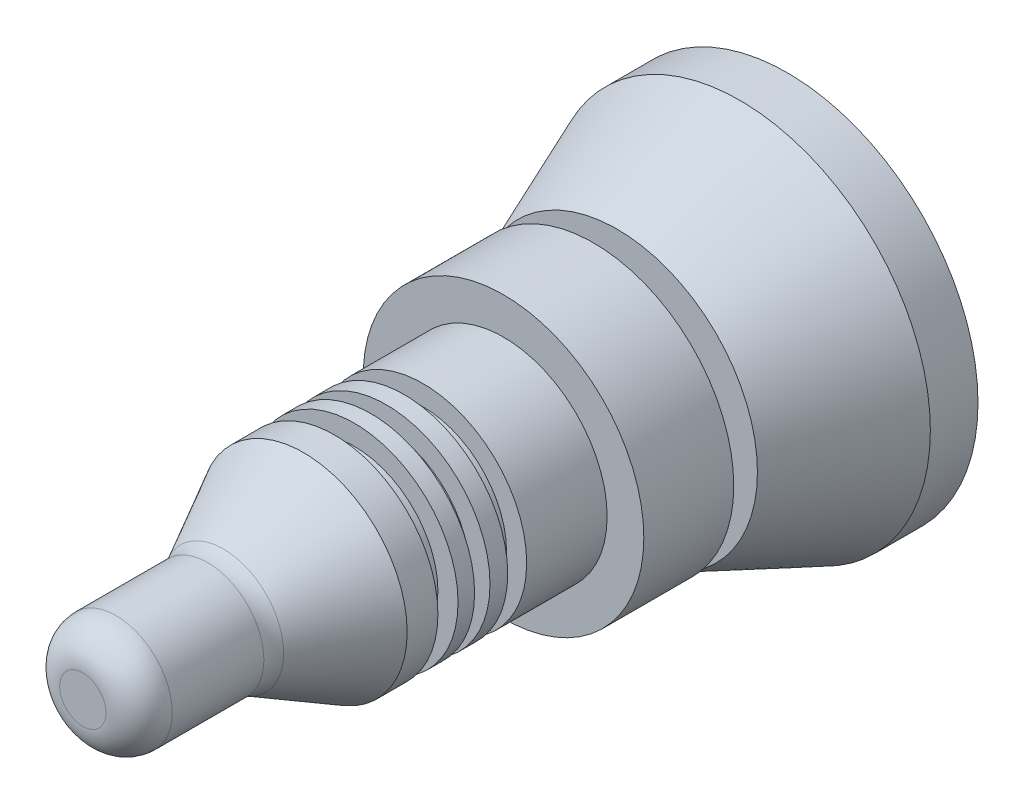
ISO-10303-21;
HEADER;
FILE_DESCRIPTION(('STEP AP214'),'2;1');
FILE_NAME('part.step','',(''),(''),'','','');
FILE_SCHEMA(('AUTOMOTIVE_DESIGN { 1 0 10303 214 1 1 1 1 }'));
ENDSEC;
DATA;
#1=APPLICATION_CONTEXT('core data for automotive mechanical design processes');
#2=APPLICATION_PROTOCOL_DEFINITION('international standard','automotive_design',2000,#1);
#3=PRODUCT_CONTEXT('',#1,'mechanical');
#4=PRODUCT('Part','Part','',(#3));
#5=PRODUCT_RELATED_PRODUCT_CATEGORY('part','',(#4));
#6=PRODUCT_DEFINITION_FORMATION('','',#4);
#7=PRODUCT_DEFINITION_CONTEXT('part definition',#1,'design');
#8=PRODUCT_DEFINITION('design','',#6,#7);
#9=PRODUCT_DEFINITION_SHAPE('','',#8);
#10=(LENGTH_UNIT() NAMED_UNIT(*) SI_UNIT(.MILLI.,.METRE.));
#11=(NAMED_UNIT(*) PLANE_ANGLE_UNIT() SI_UNIT($,.RADIAN.));
#12=(NAMED_UNIT(*) SI_UNIT($,.STERADIAN.) SOLID_ANGLE_UNIT());
#13=UNCERTAINTY_MEASURE_WITH_UNIT(LENGTH_MEASURE(1.E-05),#10,'distance_accuracy_value','');
#14=(GEOMETRIC_REPRESENTATION_CONTEXT(3) GLOBAL_UNCERTAINTY_ASSIGNED_CONTEXT((#13)) GLOBAL_UNIT_ASSIGNED_CONTEXT((#10,
#11,#12)) REPRESENTATION_CONTEXT('',''));
#15=CARTESIAN_POINT('',(0.,0.,0.));
#16=DIRECTION('',(0.,0.,1.));
#17=DIRECTION('',(1.,0.,0.));
#18=AXIS2_PLACEMENT_3D('',#15,#16,#17);
#19=CARTESIAN_POINT('',(0.,57.5552010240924,-212.836397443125));
#20=DIRECTION('',(0.,0.,1.));
#21=DIRECTION('',(1.,0.,0.));
#22=AXIS2_PLACEMENT_3D('',#19,#20,#21);
#23=PLANE('',#22);
#24=CARTESIAN_POINT('',(0.,0.,-212.836397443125));
#25=DIRECTION('',(0.,0.,1.));
#26=DIRECTION('',(1.,0.,0.));
#27=AXIS2_PLACEMENT_3D('',#24,#25,#26);
#28=CIRCLE('',#27,57.5552010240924);
#29=CARTESIAN_POINT('',(57.5552010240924,0.,-212.836397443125));
#30=VERTEX_POINT('',#29);
#31=EDGE_CURVE('E10',#30,#30,#28,.T.);
#32=ORIENTED_EDGE('',*,*,#31,.F.);
#33=EDGE_LOOP('',(#32));
#34=FACE_BOUND('',#33,.T.);
#35=ADVANCED_FACE('F29',(#34),#23,.F.);
#36=CARTESIAN_POINT('',(0.,0.,62.7325331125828));
#37=DIRECTION('',(0.,0.,1.));
#38=DIRECTION('',(1.,0.,0.));
#39=AXIS2_PLACEMENT_3D('',#36,#37,#38);
#40=CYLINDRICAL_SURFACE('',#39,57.5552010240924);
#41=CARTESIAN_POINT('',(0.,0.,-198.447054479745));
#42=DIRECTION('',(0.,0.,1.));
#43=DIRECTION('',(1.,0.,0.));
#44=AXIS2_PLACEMENT_3D('',#41,#42,#43);
#45=CIRCLE('',#44,57.5552010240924);
#46=CARTESIAN_POINT('',(57.5552010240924,0.,-198.447054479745));
#47=VERTEX_POINT('',#46);
#48=EDGE_CURVE('E35',#47,#47,#45,.T.);
#49=ORIENTED_EDGE('',*,*,#48,.F.);
#50=EDGE_LOOP('',(#49));
#51=FACE_BOUND('',#50,.T.);
#52=ORIENTED_EDGE('',*,*,#31,.T.);
#53=EDGE_LOOP('',(#52));
#54=FACE_BOUND('',#53,.T.);
#55=ADVANCED_FACE('F248',(#51,#54),#40,.T.);
#56=CARTESIAN_POINT('',(0.,0.,-198.447054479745));
#57=DIRECTION('',(0.,0.,-1.));
#58=DIRECTION('',(-1.,0.,0.));
#59=AXIS2_PLACEMENT_3D('',#56,#57,#58);
#60=CONICAL_SURFACE('',#59,57.5552010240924,0.388689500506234);
#61=CARTESIAN_POINT('',(0.,0.,-161.388824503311));
#62=DIRECTION('',(0.,0.,1.));
#63=DIRECTION('',(1.,0.,0.));
#64=AXIS2_PLACEMENT_3D('',#61,#62,#63);
#65=CIRCLE('',#64,42.3789735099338);
#66=CARTESIAN_POINT('',(42.3789735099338,0.,-161.388824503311));
#67=VERTEX_POINT('',#66);
#68=EDGE_CURVE('E39',#67,#67,#65,.T.);
#69=ORIENTED_EDGE('',*,*,#68,.F.);
#70=EDGE_LOOP('',(#69));
#71=FACE_BOUND('',#70,.T.);
#72=ORIENTED_EDGE('',*,*,#48,.T.);
#73=EDGE_LOOP('',(#72));
#74=FACE_BOUND('',#73,.T.);
#75=ADVANCED_FACE('F243',(#71,#74),#60,.T.);
#76=CARTESIAN_POINT('',(0.,22.7192052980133,-161.388824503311));
#77=DIRECTION('',(0.,0.,-1.));
#78=DIRECTION('',(-1.,0.,0.));
#79=AXIS2_PLACEMENT_3D('',#76,#77,#78);
#80=PLANE('',#79);
#81=CARTESIAN_POINT('',(0.,0.,-161.388824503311));
#82=DIRECTION('',(0.,0.,1.));
#83=DIRECTION('',(1.,0.,0.));
#84=AXIS2_PLACEMENT_3D('',#81,#82,#83);
#85=CIRCLE('',#84,22.7192052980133);
#86=CARTESIAN_POINT('',(22.7192052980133,0.,-161.388824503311));
#87=VERTEX_POINT('',#86);
#88=EDGE_CURVE('E43',#87,#87,#85,.T.);
#89=ORIENTED_EDGE('',*,*,#88,.F.);
#90=EDGE_LOOP('',(#89));
#91=FACE_BOUND('',#90,.T.);
#92=ORIENTED_EDGE('',*,*,#68,.T.);
#93=EDGE_LOOP('',(#92));
#94=FACE_BOUND('',#93,.T.);
#95=ADVANCED_FACE('F237',(#91,#94),#80,.F.);
#96=CARTESIAN_POINT('',(0.,0.,62.7325331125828));
#97=DIRECTION('',(0.,0.,1.));
#98=DIRECTION('',(1.,0.,0.));
#99=AXIS2_PLACEMENT_3D('',#96,#97,#98);
#100=CYLINDRICAL_SURFACE('',#99,22.7192052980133);
#101=CARTESIAN_POINT('',(0.,0.,-154.239817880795));
#102=DIRECTION('',(0.,0.,1.));
#103=DIRECTION('',(1.,0.,0.));
#104=AXIS2_PLACEMENT_3D('',#101,#102,#103);
#105=CIRCLE('',#104,22.7192052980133);
#106=CARTESIAN_POINT('',(22.7192052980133,0.,-154.239817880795));
#107=VERTEX_POINT('',#106);
#108=EDGE_CURVE('E48',#107,#107,#105,.T.);
#109=ORIENTED_EDGE('',*,*,#108,.F.);
#110=EDGE_LOOP('',(#109));
#111=FACE_BOUND('',#110,.T.);
#112=ORIENTED_EDGE('',*,*,#88,.T.);
#113=EDGE_LOOP('',(#112));
#114=FACE_BOUND('',#113,.T.);
#115=ADVANCED_FACE('F231',(#111,#114),#100,.T.);
#116=CARTESIAN_POINT('',(0.,42.3789735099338,-154.239817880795));
#117=DIRECTION('',(0.,0.,1.));
#118=DIRECTION('',(1.,0.,0.));
#119=AXIS2_PLACEMENT_3D('',#116,#117,#118);
#120=PLANE('',#119);
#121=CARTESIAN_POINT('',(0.,0.,-154.239817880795));
#122=DIRECTION('',(0.,0.,1.));
#123=DIRECTION('',(1.,0.,0.));
#124=AXIS2_PLACEMENT_3D('',#121,#122,#123);
#125=CIRCLE('',#124,42.3789735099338);
#126=CARTESIAN_POINT('',(42.3789735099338,0.,-154.239817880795));
#127=VERTEX_POINT('',#126);
#128=EDGE_CURVE('E51',#127,#127,#125,.T.);
#129=ORIENTED_EDGE('',*,*,#128,.F.);
#130=EDGE_LOOP('',(#129));
#131=FACE_BOUND('',#130,.T.);
#132=ORIENTED_EDGE('',*,*,#108,.T.);
#133=EDGE_LOOP('',(#132));
#134=FACE_BOUND('',#133,.T.);
#135=ADVANCED_FACE('F225',(#131,#134),#120,.F.);
#136=CARTESIAN_POINT('',(0.,0.,62.7325331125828));
#137=DIRECTION('',(0.,0.,1.));
#138=DIRECTION('',(1.,0.,0.));
#139=AXIS2_PLACEMENT_3D('',#136,#137,#138);
#140=CYLINDRICAL_SURFACE('',#139,42.3789735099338);
#141=CARTESIAN_POINT('',(0.,0.,-127.073592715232));
#142=DIRECTION('',(0.,0.,1.));
#143=DIRECTION('',(1.,0.,0.));
#144=AXIS2_PLACEMENT_3D('',#141,#142,#143);
#145=CIRCLE('',#144,42.3789735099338);
#146=CARTESIAN_POINT('',(42.3789735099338,0.,-127.073592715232));
#147=VERTEX_POINT('',#146);
#148=EDGE_CURVE('E54',#147,#147,#145,.T.);
#149=ORIENTED_EDGE('',*,*,#148,.F.);
#150=EDGE_LOOP('',(#149));
#151=FACE_BOUND('',#150,.T.);
#152=ORIENTED_EDGE('',*,*,#128,.T.);
#153=EDGE_LOOP('',(#152));
#154=FACE_BOUND('',#153,.T.);
#155=ADVANCED_FACE('F219',(#151,#154),#140,.T.);
#156=CARTESIAN_POINT('',(0.,31.2980132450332,-127.073592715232));
#157=DIRECTION('',(0.,0.,-1.));
#158=DIRECTION('',(-1.,0.,0.));
#159=AXIS2_PLACEMENT_3D('',#156,#157,#158);
#160=PLANE('',#159);
#161=CARTESIAN_POINT('',(0.,0.,-127.073592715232));
#162=DIRECTION('',(0.,0.,1.));
#163=DIRECTION('',(1.,0.,0.));
#164=AXIS2_PLACEMENT_3D('',#161,#162,#163);
#165=CIRCLE('',#164,31.2980132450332);
#166=CARTESIAN_POINT('',(31.2980132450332,0.,-127.073592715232));
#167=VERTEX_POINT('',#166);
#168=EDGE_CURVE('E57',#167,#167,#165,.T.);
#169=ORIENTED_EDGE('',*,*,#168,.F.);
#170=EDGE_LOOP('',(#169));
#171=FACE_BOUND('',#170,.T.);
#172=ORIENTED_EDGE('',*,*,#148,.T.);
#173=EDGE_LOOP('',(#172));
#174=FACE_BOUND('',#173,.T.);
#175=ADVANCED_FACE('F213',(#171,#174),#160,.F.);
#176=CARTESIAN_POINT('',(0.,0.,62.7325331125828));
#177=DIRECTION('',(0.,0.,1.));
#178=DIRECTION('',(1.,0.,0.));
#179=AXIS2_PLACEMENT_3D('',#176,#177,#178);
#180=CYLINDRICAL_SURFACE('',#179,31.2980132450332);
#181=CARTESIAN_POINT('',(0.,0.,-102.766970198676));
#182=DIRECTION('',(0.,0.,1.));
#183=DIRECTION('',(1.,0.,0.));
#184=AXIS2_PLACEMENT_3D('',#181,#182,#183);
#185=CIRCLE('',#184,31.2980132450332);
#186=CARTESIAN_POINT('',(31.2980132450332,0.,-102.766970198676));
#187=VERTEX_POINT('',#186);
#188=EDGE_CURVE('E60',#187,#187,#185,.T.);
#189=ORIENTED_EDGE('',*,*,#188,.F.);
#190=EDGE_LOOP('',(#189));
#191=FACE_BOUND('',#190,.T.);
#192=ORIENTED_EDGE('',*,*,#168,.T.);
#193=EDGE_LOOP('',(#192));
#194=FACE_BOUND('',#193,.T.);
#195=ADVANCED_FACE('F207',(#191,#194),#180,.T.);
#196=CARTESIAN_POINT('',(0.,25.221357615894,-102.766970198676));
#197=DIRECTION('',(0.,0.,-1.));
#198=DIRECTION('',(-1.,0.,0.));
#199=AXIS2_PLACEMENT_3D('',#196,#197,#198);
#200=PLANE('',#199);
#201=CARTESIAN_POINT('',(0.,0.,-102.766970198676));
#202=DIRECTION('',(0.,0.,1.));
#203=DIRECTION('',(1.,0.,0.));
#204=AXIS2_PLACEMENT_3D('',#201,#202,#203);
#205=CIRCLE('',#204,25.221357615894);
#206=CARTESIAN_POINT('',(25.221357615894,0.,-102.766970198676));
#207=VERTEX_POINT('',#206);
#208=EDGE_CURVE('E63',#207,#207,#205,.T.);
#209=ORIENTED_EDGE('',*,*,#208,.F.);
#210=EDGE_LOOP('',(#209));
#211=FACE_BOUND('',#210,.T.);
#212=ORIENTED_EDGE('',*,*,#188,.T.);
#213=EDGE_LOOP('',(#212));
#214=FACE_BOUND('',#213,.T.);
#215=ADVANCED_FACE('F201',(#211,#214),#200,.F.);
#216=CARTESIAN_POINT('',(0.,0.,62.7325331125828));
#217=DIRECTION('',(0.,0.,1.));
#218=DIRECTION('',(1.,0.,0.));
#219=AXIS2_PLACEMENT_3D('',#216,#217,#218);
#220=CYLINDRICAL_SURFACE('',#219,25.221357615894);
#221=CARTESIAN_POINT('',(0.,0.,-97.0477649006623));
#222=DIRECTION('',(0.,0.,1.));
#223=DIRECTION('',(1.,0.,0.));
#224=AXIS2_PLACEMENT_3D('',#221,#222,#223);
#225=CIRCLE('',#224,25.221357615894);
#226=CARTESIAN_POINT('',(25.221357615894,0.,-97.0477649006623));
#227=VERTEX_POINT('',#226);
#228=EDGE_CURVE('E66',#227,#227,#225,.T.);
#229=ORIENTED_EDGE('',*,*,#228,.F.);
#230=EDGE_LOOP('',(#229));
#231=FACE_BOUND('',#230,.T.);
#232=ORIENTED_EDGE('',*,*,#208,.T.);
#233=EDGE_LOOP('',(#232));
#234=FACE_BOUND('',#233,.T.);
#235=ADVANCED_FACE('F195',(#231,#234),#220,.T.);
#236=CARTESIAN_POINT('',(0.,31.2980132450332,-97.0477649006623));
#237=DIRECTION('',(0.,0.,1.));
#238=DIRECTION('',(1.,0.,0.));
#239=AXIS2_PLACEMENT_3D('',#236,#237,#238);
#240=PLANE('',#239);
#241=CARTESIAN_POINT('',(0.,0.,-97.0477649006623));
#242=DIRECTION('',(0.,0.,1.));
#243=DIRECTION('',(1.,0.,0.));
#244=AXIS2_PLACEMENT_3D('',#241,#242,#243);
#245=CIRCLE('',#244,31.2980132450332);
#246=CARTESIAN_POINT('',(31.2980132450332,0.,-97.0477649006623));
#247=VERTEX_POINT('',#246);
#248=EDGE_CURVE('E69',#247,#247,#245,.T.);
#249=ORIENTED_EDGE('',*,*,#248,.F.);
#250=EDGE_LOOP('',(#249));
#251=FACE_BOUND('',#250,.T.);
#252=ORIENTED_EDGE('',*,*,#228,.T.);
#253=EDGE_LOOP('',(#252));
#254=FACE_BOUND('',#253,.T.);
#255=ADVANCED_FACE('F189',(#251,#254),#240,.F.);
#256=CARTESIAN_POINT('',(0.,0.,62.7325331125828));
#257=DIRECTION('',(0.,0.,1.));
#258=DIRECTION('',(1.,0.,0.));
#259=AXIS2_PLACEMENT_3D('',#256,#257,#258);
#260=CYLINDRICAL_SURFACE('',#259,31.2980132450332);
#261=CARTESIAN_POINT('',(0.,0.,-91.6860099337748));
#262=DIRECTION('',(0.,0.,1.));
#263=DIRECTION('',(1.,0.,0.));
#264=AXIS2_PLACEMENT_3D('',#261,#262,#263);
#265=CIRCLE('',#264,31.2980132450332);
#266=CARTESIAN_POINT('',(31.2980132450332,0.,-91.6860099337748));
#267=VERTEX_POINT('',#266);
#268=EDGE_CURVE('E72',#267,#267,#265,.T.);
#269=ORIENTED_EDGE('',*,*,#268,.F.);
#270=EDGE_LOOP('',(#269));
#271=FACE_BOUND('',#270,.T.);
#272=ORIENTED_EDGE('',*,*,#248,.T.);
#273=EDGE_LOOP('',(#272));
#274=FACE_BOUND('',#273,.T.);
#275=ADVANCED_FACE('F183',(#271,#274),#260,.T.);
#276=CARTESIAN_POINT('',(0.,25.221357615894,-91.6860099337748));
#277=DIRECTION('',(0.,0.,-1.));
#278=DIRECTION('',(-1.,0.,0.));
#279=AXIS2_PLACEMENT_3D('',#276,#277,#278);
#280=PLANE('',#279);
#281=CARTESIAN_POINT('',(0.,0.,-91.6860099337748));
#282=DIRECTION('',(0.,0.,1.));
#283=DIRECTION('',(1.,0.,0.));
#284=AXIS2_PLACEMENT_3D('',#281,#282,#283);
#285=CIRCLE('',#284,25.221357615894);
#286=CARTESIAN_POINT('',(25.221357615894,0.,-91.6860099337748));
#287=VERTEX_POINT('',#286);
#288=EDGE_CURVE('E75',#287,#287,#285,.T.);
#289=ORIENTED_EDGE('',*,*,#288,.F.);
#290=EDGE_LOOP('',(#289));
#291=FACE_BOUND('',#290,.T.);
#292=ORIENTED_EDGE('',*,*,#268,.T.);
#293=EDGE_LOOP('',(#292));
#294=FACE_BOUND('',#293,.T.);
#295=ADVANCED_FACE('F177',(#291,#294),#280,.F.);
#296=CARTESIAN_POINT('',(0.,0.,62.7325331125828));
#297=DIRECTION('',(0.,0.,1.));
#298=DIRECTION('',(1.,0.,0.));
#299=AXIS2_PLACEMENT_3D('',#296,#297,#298);
#300=CYLINDRICAL_SURFACE('',#299,25.221357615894);
#301=CARTESIAN_POINT('',(0.,0.,-87.0391556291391));
#302=DIRECTION('',(0.,0.,1.));
#303=DIRECTION('',(1.,0.,0.));
#304=AXIS2_PLACEMENT_3D('',#301,#302,#303);
#305=CIRCLE('',#304,25.221357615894);
#306=CARTESIAN_POINT('',(25.221357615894,0.,-87.0391556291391));
#307=VERTEX_POINT('',#306);
#308=EDGE_CURVE('E78',#307,#307,#305,.T.);
#309=ORIENTED_EDGE('',*,*,#308,.F.);
#310=EDGE_LOOP('',(#309));
#311=FACE_BOUND('',#310,.T.);
#312=ORIENTED_EDGE('',*,*,#288,.T.);
#313=EDGE_LOOP('',(#312));
#314=FACE_BOUND('',#313,.T.);
#315=ADVANCED_FACE('F171',(#311,#314),#300,.T.);
#316=CARTESIAN_POINT('',(0.,31.2980132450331,-87.0391556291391));
#317=DIRECTION('',(0.,0.,1.));
#318=DIRECTION('',(1.,0.,0.));
#319=AXIS2_PLACEMENT_3D('',#316,#317,#318);
#320=PLANE('',#319);
#321=CARTESIAN_POINT('',(0.,0.,-87.0391556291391));
#322=DIRECTION('',(0.,0.,1.));
#323=DIRECTION('',(1.,0.,0.));
#324=AXIS2_PLACEMENT_3D('',#321,#322,#323);
#325=CIRCLE('',#324,31.2980132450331);
#326=CARTESIAN_POINT('',(31.2980132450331,0.,-87.0391556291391));
#327=VERTEX_POINT('',#326);
#328=EDGE_CURVE('E81',#327,#327,#325,.T.);
#329=ORIENTED_EDGE('',*,*,#328,.F.);
#330=EDGE_LOOP('',(#329));
#331=FACE_BOUND('',#330,.T.);
#332=ORIENTED_EDGE('',*,*,#308,.T.);
#333=EDGE_LOOP('',(#332));
#334=FACE_BOUND('',#333,.T.);
#335=ADVANCED_FACE('F165',(#331,#334),#320,.F.);
#336=CARTESIAN_POINT('',(0.,0.,62.7325331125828));
#337=DIRECTION('',(0.,0.,1.));
#338=DIRECTION('',(1.,0.,0.));
#339=AXIS2_PLACEMENT_3D('',#336,#337,#338);
#340=CYLINDRICAL_SURFACE('',#339,31.2980132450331);
#341=CARTESIAN_POINT('',(0.,0.,-82.0348509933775));
#342=DIRECTION('',(0.,0.,1.));
#343=DIRECTION('',(1.,0.,0.));
#344=AXIS2_PLACEMENT_3D('',#341,#342,#343);
#345=CIRCLE('',#344,31.2980132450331);
#346=CARTESIAN_POINT('',(31.2980132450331,0.,-82.0348509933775));
#347=VERTEX_POINT('',#346);
#348=EDGE_CURVE('E84',#347,#347,#345,.T.);
#349=ORIENTED_EDGE('',*,*,#348,.F.);
#350=EDGE_LOOP('',(#349));
#351=FACE_BOUND('',#350,.T.);
#352=ORIENTED_EDGE('',*,*,#328,.T.);
#353=EDGE_LOOP('',(#352));
#354=FACE_BOUND('',#353,.T.);
#355=ADVANCED_FACE('F159',(#351,#354),#340,.T.);
#356=CARTESIAN_POINT('',(0.,25.221357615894,-82.0348509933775));
#357=DIRECTION('',(0.,0.,-1.));
#358=DIRECTION('',(-1.,0.,0.));
#359=AXIS2_PLACEMENT_3D('',#356,#357,#358);
#360=PLANE('',#359);
#361=CARTESIAN_POINT('',(0.,0.,-82.0348509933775));
#362=DIRECTION('',(0.,0.,1.));
#363=DIRECTION('',(1.,0.,0.));
#364=AXIS2_PLACEMENT_3D('',#361,#362,#363);
#365=CIRCLE('',#364,25.221357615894);
#366=CARTESIAN_POINT('',(25.221357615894,0.,-82.0348509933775));
#367=VERTEX_POINT('',#366);
#368=EDGE_CURVE('E87',#367,#367,#365,.T.);
#369=ORIENTED_EDGE('',*,*,#368,.F.);
#370=EDGE_LOOP('',(#369));
#371=FACE_BOUND('',#370,.T.);
#372=ORIENTED_EDGE('',*,*,#348,.T.);
#373=EDGE_LOOP('',(#372));
#374=FACE_BOUND('',#373,.T.);
#375=ADVANCED_FACE('F153',(#371,#374),#360,.F.);
#376=CARTESIAN_POINT('',(0.,0.,62.7325331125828));
#377=DIRECTION('',(0.,0.,1.));
#378=DIRECTION('',(1.,0.,0.));
#379=AXIS2_PLACEMENT_3D('',#376,#377,#378);
#380=CYLINDRICAL_SURFACE('',#379,25.221357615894);
#381=CARTESIAN_POINT('',(0.,0.,-75.9581953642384));
#382=DIRECTION('',(0.,0.,1.));
#383=DIRECTION('',(1.,0.,0.));
#384=AXIS2_PLACEMENT_3D('',#381,#382,#383);
#385=CIRCLE('',#384,25.221357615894);
#386=CARTESIAN_POINT('',(25.221357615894,0.,-75.9581953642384));
#387=VERTEX_POINT('',#386);
#388=EDGE_CURVE('E90',#387,#387,#385,.T.);
#389=ORIENTED_EDGE('',*,*,#388,.F.);
#390=EDGE_LOOP('',(#389));
#391=FACE_BOUND('',#390,.T.);
#392=ORIENTED_EDGE('',*,*,#368,.T.);
#393=EDGE_LOOP('',(#392));
#394=FACE_BOUND('',#393,.T.);
#395=ADVANCED_FACE('F147',(#391,#394),#380,.T.);
#396=CARTESIAN_POINT('',(0.,31.2980132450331,-75.9581953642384));
#397=DIRECTION('',(0.,0.,1.));
#398=DIRECTION('',(1.,0.,0.));
#399=AXIS2_PLACEMENT_3D('',#396,#397,#398);
#400=PLANE('',#399);
#401=CARTESIAN_POINT('',(0.,0.,-75.9581953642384));
#402=DIRECTION('',(0.,0.,1.));
#403=DIRECTION('',(1.,0.,0.));
#404=AXIS2_PLACEMENT_3D('',#401,#402,#403);
#405=CIRCLE('',#404,31.2980132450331);
#406=CARTESIAN_POINT('',(31.2980132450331,0.,-75.9581953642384));
#407=VERTEX_POINT('',#406);
#408=EDGE_CURVE('E93',#407,#407,#405,.T.);
#409=ORIENTED_EDGE('',*,*,#408,.F.);
#410=EDGE_LOOP('',(#409));
#411=FACE_BOUND('',#410,.T.);
#412=ORIENTED_EDGE('',*,*,#388,.T.);
#413=EDGE_LOOP('',(#412));
#414=FACE_BOUND('',#413,.T.);
#415=ADVANCED_FACE('F141',(#411,#414),#400,.F.);
#416=CARTESIAN_POINT('',(0.,0.,62.7325331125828));
#417=DIRECTION('',(0.,0.,1.));
#418=DIRECTION('',(1.,0.,0.));
#419=AXIS2_PLACEMENT_3D('',#416,#417,#418);
#420=CYLINDRICAL_SURFACE('',#419,31.2980132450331);
#421=CARTESIAN_POINT('',(0.,0.,-66.6644867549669));
#422=DIRECTION('',(0.,0.,1.));
#423=DIRECTION('',(1.,0.,0.));
#424=AXIS2_PLACEMENT_3D('',#421,#422,#423);
#425=CIRCLE('',#424,31.2980132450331);
#426=CARTESIAN_POINT('',(31.2980132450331,0.,-66.6644867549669));
#427=VERTEX_POINT('',#426);
#428=EDGE_CURVE('E96',#427,#427,#425,.T.);
#429=ORIENTED_EDGE('',*,*,#428,.F.);
#430=EDGE_LOOP('',(#429));
#431=FACE_BOUND('',#430,.T.);
#432=ORIENTED_EDGE('',*,*,#408,.T.);
#433=EDGE_LOOP('',(#432));
#434=FACE_BOUND('',#433,.T.);
#435=ADVANCED_FACE('F135',(#431,#434),#420,.T.);
#436=CARTESIAN_POINT('',(0.,0.,-66.6644867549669));
#437=DIRECTION('',(0.,0.,-1.));
#438=DIRECTION('',(-1.,0.,0.));
#439=AXIS2_PLACEMENT_3D('',#436,#437,#438);
#440=CONICAL_SURFACE('',#439,31.2980132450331,0.495551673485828);
#441=CARTESIAN_POINT('',(0.,0.,-42.4385917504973));
#442=DIRECTION('',(0.,0.,1.));
#443=DIRECTION('',(1.,0.,0.));
#444=AXIS2_PLACEMENT_3D('',#441,#442,#443);
#445=CIRCLE('',#444,18.2029348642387);
#446=CARTESIAN_POINT('',(18.2029348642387,0.,-42.4385917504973));
#447=VERTEX_POINT('',#446);
#448=EDGE_CURVE('E99',#447,#447,#445,.T.);
#449=ORIENTED_EDGE('',*,*,#448,.F.);
#450=EDGE_LOOP('',(#449));
#451=FACE_BOUND('',#450,.T.);
#452=ORIENTED_EDGE('',*,*,#428,.T.);
#453=EDGE_LOOP('',(#452));
#454=FACE_BOUND('',#453,.T.);
#455=ADVANCED_FACE('F129',(#451,#454),#440,.T.);
#456=CARTESIAN_POINT('',(0.,0.,-37.6834214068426));
#457=DIRECTION('',(0.,0.,1.));
#458=DIRECTION('',(1.,0.,0.));
#459=AXIS2_PLACEMENT_3D('',#456,#457,#458);
#460=TOROIDAL_SURFACE('',#459,27.,10.);
#461=CARTESIAN_POINT('',(0.,0.,-37.6834214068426));
#462=DIRECTION('',(0.,0.,1.));
#463=DIRECTION('',(1.,0.,0.));
#464=AXIS2_PLACEMENT_3D('',#461,#462,#463);
#465=CIRCLE('',#464,17.);
#466=CARTESIAN_POINT('',(17.,0.,-37.6834214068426));
#467=VERTEX_POINT('',#466);
#468=EDGE_CURVE('E102',#467,#467,#465,.T.);
#469=ORIENTED_EDGE('',*,*,#468,.F.);
#470=EDGE_LOOP('',(#469));
#471=FACE_BOUND('',#470,.T.);
#472=ORIENTED_EDGE('',*,*,#448,.T.);
#473=EDGE_LOOP('',(#472));
#474=FACE_BOUND('',#473,.T.);
#475=ADVANCED_FACE('F123',(#471,#474),#460,.F.);
#476=CARTESIAN_POINT('',(0.,0.,62.7325331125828));
#477=DIRECTION('',(0.,0.,1.));
#478=DIRECTION('',(1.,0.,0.));
#479=AXIS2_PLACEMENT_3D('',#476,#477,#478);
#480=CYLINDRICAL_SURFACE('',#479,17.);
#481=CARTESIAN_POINT('',(0.,0.,-9.99999999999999));
#482=DIRECTION('',(0.,0.,1.));
#483=DIRECTION('',(1.,0.,0.));
#484=AXIS2_PLACEMENT_3D('',#481,#482,#483);
#485=CIRCLE('',#484,17.);
#486=CARTESIAN_POINT('',(17.,0.,-9.99999999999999));
#487=VERTEX_POINT('',#486);
#488=EDGE_CURVE('E105',#487,#487,#485,.T.);
#489=ORIENTED_EDGE('',*,*,#488,.F.);
#490=EDGE_LOOP('',(#489));
#491=FACE_BOUND('',#490,.T.);
#492=ORIENTED_EDGE('',*,*,#468,.T.);
#493=EDGE_LOOP('',(#492));
#494=FACE_BOUND('',#493,.T.);
#495=ADVANCED_FACE('F117',(#491,#494),#480,.T.);
#496=CARTESIAN_POINT('',(0.,0.,-10.));
#497=DIRECTION('',(0.,0.,1.));
#498=DIRECTION('',(1.,0.,0.));
#499=AXIS2_PLACEMENT_3D('',#496,#497,#498);
#500=DEGENERATE_TOROIDAL_SURFACE('',#499,7.,10.,.T.);
#501=CARTESIAN_POINT('',(0.,0.,0.));
#502=DIRECTION('',(0.,0.,1.));
#503=DIRECTION('',(1.,0.,0.));
#504=AXIS2_PLACEMENT_3D('',#501,#502,#503);
#505=CIRCLE('',#504,7.);
#506=CARTESIAN_POINT('',(7.,0.,0.));
#507=VERTEX_POINT('',#506);
#508=EDGE_CURVE('E108',#507,#507,#505,.T.);
#509=ORIENTED_EDGE('',*,*,#508,.F.);
#510=EDGE_LOOP('',(#509));
#511=FACE_BOUND('',#510,.T.);
#512=ORIENTED_EDGE('',*,*,#488,.T.);
#513=EDGE_LOOP('',(#512));
#514=FACE_BOUND('',#513,.T.);
#515=ADVANCED_FACE('F114',(#511,#514),#500,.T.);
#516=CARTESIAN_POINT('',(0.,0.,0.));
#517=DIRECTION('',(0.,0.,-1.));
#518=DIRECTION('',(-1.,0.,0.));
#519=AXIS2_PLACEMENT_3D('',#516,#517,#518);
#520=PLANE('',#519);
#521=ORIENTED_EDGE('',*,*,#508,.T.);
#522=EDGE_LOOP('',(#521));
#523=FACE_BOUND('',#522,.T.);
#524=ADVANCED_FACE('F112',(#523),#520,.F.);
#525=CLOSED_SHELL('',(#35,#55,#75,#95,#115,#135,#155,#175,#195,#215,#235,#255,#275,#295,#315,
#335,#355,#375,#395,#415,#435,#455,#475,#495,#515,#524));
#526=MANIFOLD_SOLID_BREP('B2',#525);
#527=ADVANCED_BREP_SHAPE_REPRESENTATION('',(#18,#526),#14);
#528=SHAPE_DEFINITION_REPRESENTATION(#9,#527);
ENDSEC;
END-ISO-10303-21;
